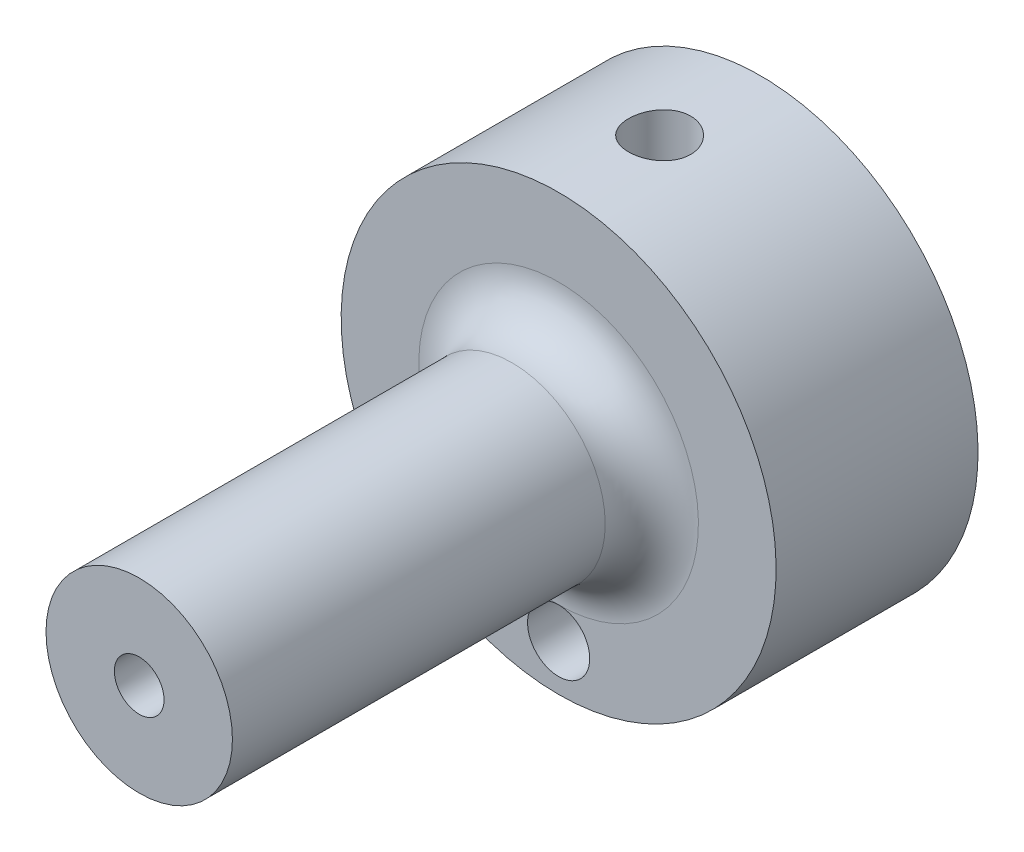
from build123d import *


with BuildPart() as part:
    # Sketch1 → Revolve1 (revolve)
    with BuildSketch(Plane(origin=(0, 0, 0), x_dir=(0, 0, -1), z_dir=(1, 0, 0)), mode=Mode.PRIVATE) as revolve1_sk:
        with BuildLine():
            Line((-27, 1.599074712), (13, 1.25))
            Line((13, 1.25), (13, 14))
            Line((13, 14), (0, 14))
            Line((0, 14), (0, 9))
            ThreePointArc((0, 9), (-0.878679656, 6.878679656), (-3, 6))
            Line((-3, 6), (-27, 6))
            Line((-27, 6), (-27, 1.599074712))
        make_face()
    revolve(revolve1_sk.sketch.rotate(Axis((0, 0, 27), (0, 0, -1)), 180), axis=Axis((0, 0, 27), (0, 0, -1)))

    # Sketch2 → Cut-Revolve1 (revolve, cut)
    with BuildSketch(Plane(origin=(0, 0, 0), x_dir=(0, 0, -1), z_dir=(1, 0, 0)), mode=Mode.PRIVATE) as cut_revolve1_sk:
        Polygon((8.5, 14), (6.5, 14), (6.5, 6.798278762), (8.5, 8), align=None)
    revolve(cut_revolve1_sk.sketch.rotate(Axis((0, 14, -6.5), (0, -1, 0)), 180), axis=Axis((0, 14, -6.5), (0, -1, 0)), mode=Mode.SUBTRACT)

    # Sketch3 → Cut-Revolve2 (revolve, cut)
    with BuildSketch(Plane(origin=(0, -17.5, -14), x_dir=(0, 1, 0), z_dir=(1, 0, 0)), mode=Mode.PRIVATE) as cut_revolve2_sk:
        Polygon((8.5, 14), (6.5, 14), (6.5, 6.798278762), (8.5, 8), align=None)
    revolve(cut_revolve2_sk.sketch.rotate(Axis((0, -11, 0), (0, 0, -1)), 90), axis=Axis((0, -11, 0), (0, 0, -1)), mode=Mode.SUBTRACT)

    # Sketch4 → Cut-Revolve3 (revolve, cut)
    with BuildSketch(Plane(origin=(0, 0, 0), x_dir=(0, 0, -1), z_dir=(1, 0, 0)), mode=Mode.PRIVATE) as cut_revolve3_sk:
        with BuildLine():
            Line((13, 0), (13, 6.652067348))
            ThreePointArc((13, 6.652067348), (11.879649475, 3.409545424), (11.5, 0))
            Line((11.5, 0), (13, 0))
        make_face()
    revolve(cut_revolve3_sk.sketch.rotate(Axis((0, 0, -11.5), (0, 0, -1)), 180), axis=Axis((0, 0, -11.5), (0, 0, -1)), mode=Mode.SUBTRACT)


solid = part.part
